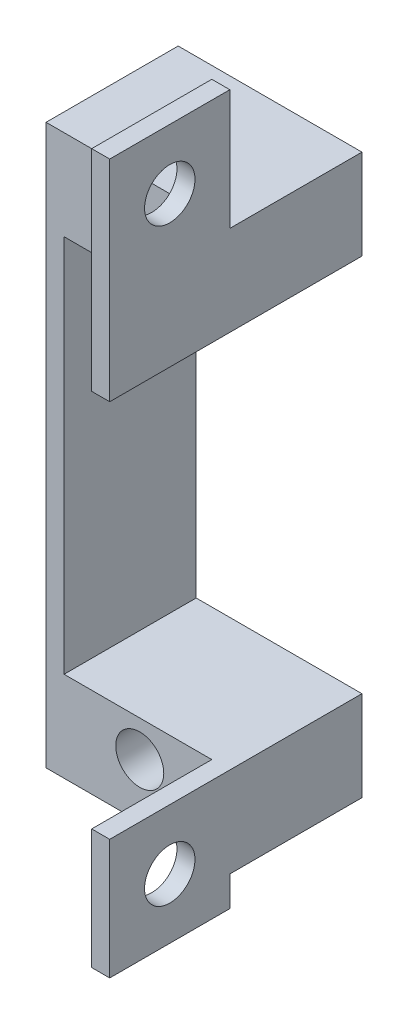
ISO-10303-21;
HEADER;
FILE_DESCRIPTION(('STEP AP214'),'2;1');
FILE_NAME('part.step','',(''),(''),'','','');
FILE_SCHEMA(('AUTOMOTIVE_DESIGN { 1 0 10303 214 1 1 1 1 }'));
ENDSEC;
DATA;
#1=APPLICATION_CONTEXT('core data for automotive mechanical design processes');
#2=APPLICATION_PROTOCOL_DEFINITION('international standard','automotive_design',2000,#1);
#3=PRODUCT_CONTEXT('',#1,'mechanical');
#4=PRODUCT('Part','Part','',(#3));
#5=PRODUCT_RELATED_PRODUCT_CATEGORY('part','',(#4));
#6=PRODUCT_DEFINITION_FORMATION('','',#4);
#7=PRODUCT_DEFINITION_CONTEXT('part definition',#1,'design');
#8=PRODUCT_DEFINITION('design','',#6,#7);
#9=PRODUCT_DEFINITION_SHAPE('','',#8);
#10=(LENGTH_UNIT() NAMED_UNIT(*) SI_UNIT(.MILLI.,.METRE.));
#11=(NAMED_UNIT(*) PLANE_ANGLE_UNIT() SI_UNIT($,.RADIAN.));
#12=(NAMED_UNIT(*) SI_UNIT($,.STERADIAN.) SOLID_ANGLE_UNIT());
#13=UNCERTAINTY_MEASURE_WITH_UNIT(LENGTH_MEASURE(1.E-05),#10,'distance_accuracy_value','');
#14=(GEOMETRIC_REPRESENTATION_CONTEXT(3) GLOBAL_UNCERTAINTY_ASSIGNED_CONTEXT((#13)) GLOBAL_UNIT_ASSIGNED_CONTEXT((#10,
#11,#12)) REPRESENTATION_CONTEXT('',''));
#15=CARTESIAN_POINT('',(0.,0.,0.));
#16=DIRECTION('',(0.,0.,1.));
#17=DIRECTION('',(1.,0.,0.));
#18=AXIS2_PLACEMENT_3D('',#15,#16,#17);
#19=CARTESIAN_POINT('',(0.,0.,11.));
#20=DIRECTION('',(0.,0.,-1.));
#21=DIRECTION('',(-1.,0.,0.));
#22=AXIS2_PLACEMENT_3D('',#19,#20,#21);
#23=PLANE('',#22);
#24=CARTESIAN_POINT('',(-17.0784720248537,38.4232292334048,11.));
#25=DIRECTION('',(0.,0.,1.));
#26=DIRECTION('',(1.,0.,0.));
#27=AXIS2_PLACEMENT_3D('',#24,#25,#26);
#28=CIRCLE('',#27,2.);
#29=CARTESIAN_POINT('',(-15.0784720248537,38.4232292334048,11.));
#30=VERTEX_POINT('',#29);
#31=EDGE_CURVE('E242',#30,#30,#28,.T.);
#32=ORIENTED_EDGE('',*,*,#31,.F.);
#33=EDGE_LOOP('',(#32));
#34=FACE_BOUND('',#33,.T.);
#35=CARTESIAN_POINT('',(-17.0784720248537,0.87322923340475,11.));
#36=DIRECTION('',(0.,0.,-1.));
#37=DIRECTION('',(1.,0.,0.));
#38=AXIS2_PLACEMENT_3D('',#35,#36,#37);
#39=CIRCLE('',#38,2.);
#40=CARTESIAN_POINT('',(-15.0784720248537,0.87322923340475,11.));
#41=VERTEX_POINT('',#40);
#42=EDGE_CURVE('E175',#41,#41,#39,.T.);
#43=ORIENTED_EDGE('',*,*,#42,.T.);
#44=EDGE_LOOP('',(#43));
#45=FACE_BOUND('',#44,.T.);
#46=DIRECTION('',(0.,-1.,0.));
#47=VECTOR('',#46,1.);
#48=CARTESIAN_POINT('',(-11.0784720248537,-3.62677076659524,11.));
#49=LINE('',#48,#47);
#50=CARTESIAN_POINT('',(-11.0784720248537,3.87322923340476,11.));
#51=VERTEX_POINT('',#50);
#52=CARTESIAN_POINT('',(-11.0784720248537,-3.62677076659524,11.));
#53=VERTEX_POINT('',#52);
#54=EDGE_CURVE('E56',#51,#53,#49,.T.);
#55=ORIENTED_EDGE('',*,*,#54,.F.);
#56=DIRECTION('',(-1.,0.,0.));
#57=VECTOR('',#56,1.);
#58=CARTESIAN_POINT('',(3.73505493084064,3.87322923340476,11.));
#59=LINE('',#58,#57);
#60=CARTESIAN_POINT('',(-23.3784720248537,3.87322923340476,11.));
#61=VERTEX_POINT('',#60);
#62=EDGE_CURVE('E193',#51,#61,#59,.T.);
#63=ORIENTED_EDGE('',*,*,#62,.T.);
#64=DIRECTION('',(0.,1.,0.));
#65=VECTOR('',#64,1.);
#66=CARTESIAN_POINT('',(-23.3784720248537,19.6482292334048,11.));
#67=LINE('',#66,#65);
#68=CARTESIAN_POINT('',(-23.3784720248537,35.4232292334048,11.));
#69=VERTEX_POINT('',#68);
#70=EDGE_CURVE('E251',#61,#69,#67,.T.);
#71=ORIENTED_EDGE('',*,*,#70,.T.);
#72=DIRECTION('',(1.,0.,0.));
#73=VECTOR('',#72,1.);
#74=CARTESIAN_POINT('',(-9.57847202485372,35.4232292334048,11.));
#75=LINE('',#74,#73);
#76=CARTESIAN_POINT('',(-11.0784720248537,35.4232292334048,11.));
#77=VERTEX_POINT('',#76);
#78=EDGE_CURVE('E262',#69,#77,#75,.T.);
#79=ORIENTED_EDGE('',*,*,#78,.T.);
#80=DIRECTION('',(0.,1.,0.));
#81=VECTOR('',#80,1.);
#82=CARTESIAN_POINT('',(-11.0784720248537,35.4232292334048,11.));
#83=LINE('',#82,#81);
#84=CARTESIAN_POINT('',(-11.0784720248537,42.9232292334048,11.));
#85=VERTEX_POINT('',#84);
#86=EDGE_CURVE('E230',#77,#85,#83,.T.);
#87=ORIENTED_EDGE('',*,*,#86,.T.);
#88=DIRECTION('',(-1.,0.,0.));
#89=VECTOR('',#88,1.);
#90=CARTESIAN_POINT('',(-9.57847202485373,42.9232292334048,11.));
#91=LINE('',#90,#89);
#92=CARTESIAN_POINT('',(-24.8784720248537,42.9232292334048,11.));
#93=VERTEX_POINT('',#92);
#94=EDGE_CURVE('E256',#85,#93,#91,.T.);
#95=ORIENTED_EDGE('',*,*,#94,.T.);
#96=DIRECTION('',(0.,-1.,0.));
#97=VECTOR('',#96,1.);
#98=CARTESIAN_POINT('',(-24.8784720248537,42.9232292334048,11.));
#99=LINE('',#98,#97);
#100=CARTESIAN_POINT('',(-24.8784720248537,-3.62677076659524,11.));
#101=VERTEX_POINT('',#100);
#102=EDGE_CURVE('E258',#93,#101,#99,.T.);
#103=ORIENTED_EDGE('',*,*,#102,.T.);
#104=DIRECTION('',(-1.,0.,0.));
#105=VECTOR('',#104,1.);
#106=CARTESIAN_POINT('',(-24.8784720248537,-3.62677076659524,11.));
#107=LINE('',#106,#105);
#108=EDGE_CURVE('E203',#53,#101,#107,.T.);
#109=ORIENTED_EDGE('',*,*,#108,.F.);
#110=EDGE_LOOP('',(#55,#63,#71,#79,#87,#95,#103,#109));
#111=FACE_BOUND('',#110,.T.);
#112=ADVANCED_FACE('F34',(#34,#45,#111),#23,.F.);
#113=CARTESIAN_POINT('',(-23.3784720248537,19.6482292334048,11.));
#114=DIRECTION('',(-1.,0.,0.));
#115=DIRECTION('',(0.,0.,1.));
#116=AXIS2_PLACEMENT_3D('',#113,#114,#115);
#117=PLANE('',#116);
#118=DIRECTION('',(0.,0.,1.));
#119=VECTOR('',#118,1.);
#120=CARTESIAN_POINT('',(-23.3784720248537,3.87322923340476,11.));
#121=LINE('',#120,#119);
#122=CARTESIAN_POINT('',(-23.3784720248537,3.87322923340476,0.));
#123=VERTEX_POINT('',#122);
#124=EDGE_CURVE('E181',#123,#61,#121,.T.);
#125=ORIENTED_EDGE('',*,*,#124,.F.);
#126=DIRECTION('',(0.,1.,0.));
#127=VECTOR('',#126,1.);
#128=CARTESIAN_POINT('',(-23.3784720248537,19.6482292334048,0.));
#129=LINE('',#128,#127);
#130=CARTESIAN_POINT('',(-23.3784720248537,35.4232292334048,0.));
#131=VERTEX_POINT('',#130);
#132=EDGE_CURVE('E253',#123,#131,#129,.T.);
#133=ORIENTED_EDGE('',*,*,#132,.T.);
#134=DIRECTION('',(0.,0.,1.));
#135=VECTOR('',#134,1.);
#136=CARTESIAN_POINT('',(-23.3784720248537,35.4232292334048,11.));
#137=LINE('',#136,#135);
#138=EDGE_CURVE('E246',#131,#69,#137,.T.);
#139=ORIENTED_EDGE('',*,*,#138,.T.);
#140=ORIENTED_EDGE('',*,*,#70,.F.);
#141=EDGE_LOOP('',(#125,#133,#139,#140));
#142=FACE_BOUND('',#141,.T.);
#143=ADVANCED_FACE('F317',(#142),#117,.F.);
#144=CARTESIAN_POINT('',(-9.57847202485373,42.9232292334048,11.));
#145=DIRECTION('',(0.,-1.,0.));
#146=DIRECTION('',(0.,0.,-1.));
#147=AXIS2_PLACEMENT_3D('',#144,#145,#146);
#148=PLANE('',#147);
#149=DIRECTION('',(-1.,0.,0.));
#150=VECTOR('',#149,1.);
#151=CARTESIAN_POINT('',(-11.0784720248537,42.9232292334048,11.));
#152=LINE('',#151,#150);
#153=CARTESIAN_POINT('',(-9.57847202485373,42.9232292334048,11.));
#154=VERTEX_POINT('',#153);
#155=EDGE_CURVE('E211',#154,#85,#152,.T.);
#156=ORIENTED_EDGE('',*,*,#155,.F.);
#157=DIRECTION('',(0.,0.,-1.));
#158=VECTOR('',#157,1.);
#159=CARTESIAN_POINT('',(-9.57847202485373,42.9232292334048,11.));
#160=LINE('',#159,#158);
#161=CARTESIAN_POINT('',(-9.57847202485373,42.9232292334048,0.));
#162=VERTEX_POINT('',#161);
#163=EDGE_CURVE('E11',#154,#162,#160,.T.);
#164=ORIENTED_EDGE('',*,*,#163,.T.);
#165=DIRECTION('',(-1.,0.,0.));
#166=VECTOR('',#165,1.);
#167=CARTESIAN_POINT('',(-9.57847202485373,42.9232292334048,0.));
#168=LINE('',#167,#166);
#169=CARTESIAN_POINT('',(-24.8784720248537,42.9232292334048,0.));
#170=VERTEX_POINT('',#169);
#171=EDGE_CURVE('E268',#162,#170,#168,.T.);
#172=ORIENTED_EDGE('',*,*,#171,.T.);
#173=DIRECTION('',(0.,0.,-1.));
#174=VECTOR('',#173,1.);
#175=CARTESIAN_POINT('',(-24.8784720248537,42.9232292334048,11.));
#176=LINE('',#175,#174);
#177=EDGE_CURVE('E42',#93,#170,#176,.T.);
#178=ORIENTED_EDGE('',*,*,#177,.F.);
#179=ORIENTED_EDGE('',*,*,#94,.F.);
#180=EDGE_LOOP('',(#156,#164,#172,#178,#179));
#181=FACE_BOUND('',#180,.T.);
#182=ADVANCED_FACE('F291',(#181),#148,.F.);
#183=CARTESIAN_POINT('',(-9.57847202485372,35.4232292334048,11.));
#184=DIRECTION('',(0.,1.,0.));
#185=DIRECTION('',(0.,0.,1.));
#186=AXIS2_PLACEMENT_3D('',#183,#184,#185);
#187=PLANE('',#186);
#188=ORIENTED_EDGE('',*,*,#138,.F.);
#189=DIRECTION('',(1.,0.,0.));
#190=VECTOR('',#189,1.);
#191=CARTESIAN_POINT('',(-9.57847202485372,35.4232292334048,0.));
#192=LINE('',#191,#190);
#193=CARTESIAN_POINT('',(-9.57847202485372,35.4232292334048,0.));
#194=VERTEX_POINT('',#193);
#195=EDGE_CURVE('E259',#131,#194,#192,.T.);
#196=ORIENTED_EDGE('',*,*,#195,.T.);
#197=DIRECTION('',(0.,0.,-1.));
#198=VECTOR('',#197,1.);
#199=CARTESIAN_POINT('',(-9.57847202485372,35.4232292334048,11.));
#200=LINE('',#199,#198);
#201=CARTESIAN_POINT('',(-9.57847202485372,35.4232292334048,21.));
#202=VERTEX_POINT('',#201);
#203=EDGE_CURVE('E265',#202,#194,#200,.T.);
#204=ORIENTED_EDGE('',*,*,#203,.F.);
#205=DIRECTION('',(-1.,0.,0.));
#206=VECTOR('',#205,1.);
#207=CARTESIAN_POINT('',(-9.57847202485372,35.4232292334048,21.));
#208=LINE('',#207,#206);
#209=CARTESIAN_POINT('',(-11.0784720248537,35.4232292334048,21.));
#210=VERTEX_POINT('',#209);
#211=EDGE_CURVE('E233',#202,#210,#208,.T.);
#212=ORIENTED_EDGE('',*,*,#211,.T.);
#213=DIRECTION('',(0.,0.,-1.));
#214=VECTOR('',#213,1.);
#215=CARTESIAN_POINT('',(-11.0784720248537,35.4232292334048,21.));
#216=LINE('',#215,#214);
#217=EDGE_CURVE('E238',#210,#77,#216,.T.);
#218=ORIENTED_EDGE('',*,*,#217,.T.);
#219=ORIENTED_EDGE('',*,*,#78,.F.);
#220=EDGE_LOOP('',(#188,#196,#204,#212,#218,#219));
#221=FACE_BOUND('',#220,.T.);
#222=ADVANCED_FACE('F311',(#221),#187,.F.);
#223=CARTESIAN_POINT('',(-9.57847202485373,42.9232292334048,11.));
#224=DIRECTION('',(-1.,0.,0.));
#225=DIRECTION('',(0.,-1.,0.));
#226=AXIS2_PLACEMENT_3D('',#223,#224,#225);
#227=PLANE('',#226);
#228=CARTESIAN_POINT('',(-9.57847202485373,47.9232292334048,16.));
#229=DIRECTION('',(-1.,0.,0.));
#230=DIRECTION('',(0.,-1.,0.));
#231=AXIS2_PLACEMENT_3D('',#228,#229,#230);
#232=CIRCLE('',#231,2.1);
#233=CARTESIAN_POINT('',(-9.57847202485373,45.8232292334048,16.));
#234=VERTEX_POINT('',#233);
#235=EDGE_CURVE('E208',#234,#234,#232,.T.);
#236=ORIENTED_EDGE('',*,*,#235,.T.);
#237=EDGE_LOOP('',(#236));
#238=FACE_BOUND('',#237,.T.);
#239=DIRECTION('',(0.,1.,0.));
#240=VECTOR('',#239,1.);
#241=CARTESIAN_POINT('',(-9.57847202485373,42.9232292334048,0.));
#242=LINE('',#241,#240);
#243=EDGE_CURVE('E255',#194,#162,#242,.T.);
#244=ORIENTED_EDGE('',*,*,#243,.T.);
#245=ORIENTED_EDGE('',*,*,#163,.F.);
#246=DIRECTION('',(0.,-1.,0.));
#247=VECTOR('',#246,1.);
#248=CARTESIAN_POINT('',(-9.57847202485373,52.9232292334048,11.));
#249=LINE('',#248,#247);
#250=CARTESIAN_POINT('',(-9.57847202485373,52.9232292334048,11.));
#251=VERTEX_POINT('',#250);
#252=EDGE_CURVE('E227',#251,#154,#249,.T.);
#253=ORIENTED_EDGE('',*,*,#252,.F.);
#254=DIRECTION('',(0.,0.,-1.));
#255=VECTOR('',#254,1.);
#256=CARTESIAN_POINT('',(-9.57847202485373,52.9232292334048,21.));
#257=LINE('',#256,#255);
#258=CARTESIAN_POINT('',(-9.57847202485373,52.9232292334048,21.));
#259=VERTEX_POINT('',#258);
#260=EDGE_CURVE('E218',#259,#251,#257,.T.);
#261=ORIENTED_EDGE('',*,*,#260,.F.);
#262=DIRECTION('',(0.,1.,0.));
#263=VECTOR('',#262,1.);
#264=CARTESIAN_POINT('',(-9.57847202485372,35.4232292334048,21.));
#265=LINE('',#264,#263);
#266=EDGE_CURVE('E236',#202,#259,#265,.T.);
#267=ORIENTED_EDGE('',*,*,#266,.F.);
#268=ORIENTED_EDGE('',*,*,#203,.T.);
#269=EDGE_LOOP('',(#244,#245,#253,#261,#267,#268));
#270=FACE_BOUND('',#269,.T.);
#271=ADVANCED_FACE('F36',(#238,#270),#227,.F.);
#272=CARTESIAN_POINT('',(-24.8784720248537,42.9232292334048,11.));
#273=DIRECTION('',(1.,0.,0.));
#274=DIRECTION('',(0.,0.,-1.));
#275=AXIS2_PLACEMENT_3D('',#272,#273,#274);
#276=PLANE('',#275);
#277=DIRECTION('',(0.,-1.,0.));
#278=VECTOR('',#277,1.);
#279=CARTESIAN_POINT('',(-24.8784720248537,42.9232292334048,0.));
#280=LINE('',#279,#278);
#281=CARTESIAN_POINT('',(-24.8784720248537,-3.62677076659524,0.));
#282=VERTEX_POINT('',#281);
#283=EDGE_CURVE('E270',#170,#282,#280,.T.);
#284=ORIENTED_EDGE('',*,*,#283,.T.);
#285=DIRECTION('',(0.,0.,-1.));
#286=VECTOR('',#285,1.);
#287=CARTESIAN_POINT('',(-24.8784720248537,-3.62677076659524,11.));
#288=LINE('',#287,#286);
#289=EDGE_CURVE('E190',#101,#282,#288,.T.);
#290=ORIENTED_EDGE('',*,*,#289,.F.);
#291=ORIENTED_EDGE('',*,*,#102,.F.);
#292=ORIENTED_EDGE('',*,*,#177,.T.);
#293=EDGE_LOOP('',(#284,#290,#291,#292));
#294=FACE_BOUND('',#293,.T.);
#295=ADVANCED_FACE('F279',(#294),#276,.F.);
#296=CARTESIAN_POINT('',(0.,0.,0.));
#297=DIRECTION('',(0.,0.,-1.));
#298=DIRECTION('',(-1.,0.,0.));
#299=AXIS2_PLACEMENT_3D('',#296,#297,#298);
#300=PLANE('',#299);
#301=CARTESIAN_POINT('',(-17.0784720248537,0.87322923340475,0.));
#302=DIRECTION('',(0.,0.,-1.));
#303=DIRECTION('',(1.,0.,0.));
#304=AXIS2_PLACEMENT_3D('',#301,#302,#303);
#305=CIRCLE('',#304,2.);
#306=CARTESIAN_POINT('',(-15.0784720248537,0.87322923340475,0.));
#307=VERTEX_POINT('',#306);
#308=EDGE_CURVE('E178',#307,#307,#305,.T.);
#309=ORIENTED_EDGE('',*,*,#308,.F.);
#310=EDGE_LOOP('',(#309));
#311=FACE_BOUND('',#310,.T.);
#312=CARTESIAN_POINT('',(-17.0784720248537,38.4232292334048,0.));
#313=DIRECTION('',(0.,0.,1.));
#314=DIRECTION('',(1.,0.,0.));
#315=AXIS2_PLACEMENT_3D('',#312,#313,#314);
#316=CIRCLE('',#315,2.);
#317=CARTESIAN_POINT('',(-15.0784720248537,38.4232292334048,0.));
#318=VERTEX_POINT('',#317);
#319=EDGE_CURVE('E243',#318,#318,#316,.T.);
#320=ORIENTED_EDGE('',*,*,#319,.T.);
#321=EDGE_LOOP('',(#320));
#322=FACE_BOUND('',#321,.T.);
#323=ORIENTED_EDGE('',*,*,#243,.F.);
#324=ORIENTED_EDGE('',*,*,#195,.F.);
#325=ORIENTED_EDGE('',*,*,#132,.F.);
#326=DIRECTION('',(-1.,0.,0.));
#327=VECTOR('',#326,1.);
#328=CARTESIAN_POINT('',(3.73505493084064,3.87322923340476,0.));
#329=LINE('',#328,#327);
#330=CARTESIAN_POINT('',(-9.57847202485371,3.87322923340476,0.));
#331=VERTEX_POINT('',#330);
#332=EDGE_CURVE('E195',#331,#123,#329,.T.);
#333=ORIENTED_EDGE('',*,*,#332,.F.);
#334=DIRECTION('',(0.,-1.,0.));
#335=VECTOR('',#334,1.);
#336=CARTESIAN_POINT('',(-9.57847202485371,-3.62677076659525,0.));
#337=LINE('',#336,#335);
#338=CARTESIAN_POINT('',(-9.57847202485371,-3.62677076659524,0.));
#339=VERTEX_POINT('',#338);
#340=EDGE_CURVE('E184',#331,#339,#337,.T.);
#341=ORIENTED_EDGE('',*,*,#340,.T.);
#342=DIRECTION('',(1.,0.,0.));
#343=VECTOR('',#342,1.);
#344=CARTESIAN_POINT('',(-24.8784720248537,-3.62677076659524,0.));
#345=LINE('',#344,#343);
#346=EDGE_CURVE('E201',#282,#339,#345,.T.);
#347=ORIENTED_EDGE('',*,*,#346,.F.);
#348=ORIENTED_EDGE('',*,*,#283,.F.);
#349=ORIENTED_EDGE('',*,*,#171,.F.);
#350=EDGE_LOOP('',(#323,#324,#325,#333,#341,#347,#348,#349));
#351=FACE_BOUND('',#350,.T.);
#352=ADVANCED_FACE('F286',(#311,#322,#351),#300,.T.);
#353=CARTESIAN_POINT('',(-17.0784720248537,38.4232292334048,0.));
#354=DIRECTION('',(0.,0.,1.));
#355=DIRECTION('',(1.,0.,0.));
#356=AXIS2_PLACEMENT_3D('',#353,#354,#355);
#357=CYLINDRICAL_SURFACE('',#356,2.);
#358=ORIENTED_EDGE('',*,*,#319,.F.);
#359=EDGE_LOOP('',(#358));
#360=FACE_BOUND('',#359,.T.);
#361=ORIENTED_EDGE('',*,*,#31,.T.);
#362=EDGE_LOOP('',(#361));
#363=FACE_BOUND('',#362,.T.);
#364=ADVANCED_FACE('F364',(#360,#363),#357,.F.);
#365=CARTESIAN_POINT('',(-11.0784720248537,35.4232292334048,21.));
#366=DIRECTION('',(-1.,0.,0.));
#367=DIRECTION('',(0.,-1.,0.));
#368=AXIS2_PLACEMENT_3D('',#365,#366,#367);
#369=PLANE('',#368);
#370=CARTESIAN_POINT('',(-11.0784720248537,47.9232292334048,16.));
#371=DIRECTION('',(-1.,0.,0.));
#372=DIRECTION('',(0.,-1.,0.));
#373=AXIS2_PLACEMENT_3D('',#370,#371,#372);
#374=CIRCLE('',#373,2.1);
#375=CARTESIAN_POINT('',(-11.0784720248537,45.8232292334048,16.));
#376=VERTEX_POINT('',#375);
#377=EDGE_CURVE('E205',#376,#376,#374,.T.);
#378=ORIENTED_EDGE('',*,*,#377,.F.);
#379=EDGE_LOOP('',(#378));
#380=FACE_BOUND('',#379,.T.);
#381=ORIENTED_EDGE('',*,*,#86,.F.);
#382=ORIENTED_EDGE('',*,*,#217,.F.);
#383=DIRECTION('',(0.,1.,0.));
#384=VECTOR('',#383,1.);
#385=CARTESIAN_POINT('',(-11.0784720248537,35.4232292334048,21.));
#386=LINE('',#385,#384);
#387=CARTESIAN_POINT('',(-11.0784720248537,52.9232292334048,21.));
#388=VERTEX_POINT('',#387);
#389=EDGE_CURVE('E231',#210,#388,#386,.T.);
#390=ORIENTED_EDGE('',*,*,#389,.T.);
#391=DIRECTION('',(0.,0.,1.));
#392=VECTOR('',#391,1.);
#393=CARTESIAN_POINT('',(-11.0784720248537,52.9232292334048,21.));
#394=LINE('',#393,#392);
#395=CARTESIAN_POINT('',(-11.0784720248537,52.9232292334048,11.));
#396=VERTEX_POINT('',#395);
#397=EDGE_CURVE('E212',#396,#388,#394,.T.);
#398=ORIENTED_EDGE('',*,*,#397,.F.);
#399=DIRECTION('',(0.,-1.,0.));
#400=VECTOR('',#399,1.);
#401=CARTESIAN_POINT('',(-11.0784720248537,52.9232292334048,11.));
#402=LINE('',#401,#400);
#403=EDGE_CURVE('E222',#396,#85,#402,.T.);
#404=ORIENTED_EDGE('',*,*,#403,.T.);
#405=EDGE_LOOP('',(#381,#382,#390,#398,#404));
#406=FACE_BOUND('',#405,.T.);
#407=ADVANCED_FACE('F403',(#380,#406),#369,.T.);
#408=CARTESIAN_POINT('',(0.,0.,21.));
#409=DIRECTION('',(0.,0.,-1.));
#410=DIRECTION('',(-1.,0.,0.));
#411=AXIS2_PLACEMENT_3D('',#408,#409,#410);
#412=PLANE('',#411);
#413=ORIENTED_EDGE('',*,*,#266,.T.);
#414=DIRECTION('',(1.,0.,0.));
#415=VECTOR('',#414,1.);
#416=CARTESIAN_POINT('',(-11.0784720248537,52.9232292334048,21.));
#417=LINE('',#416,#415);
#418=EDGE_CURVE('E215',#388,#259,#417,.T.);
#419=ORIENTED_EDGE('',*,*,#418,.F.);
#420=ORIENTED_EDGE('',*,*,#389,.F.);
#421=ORIENTED_EDGE('',*,*,#211,.F.);
#422=EDGE_LOOP('',(#413,#419,#420,#421));
#423=FACE_BOUND('',#422,.T.);
#424=ADVANCED_FACE('F308',(#423),#412,.F.);
#425=CARTESIAN_POINT('',(-11.0784720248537,52.9232292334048,11.));
#426=DIRECTION('',(0.,0.,1.));
#427=DIRECTION('',(1.,0.,0.));
#428=AXIS2_PLACEMENT_3D('',#425,#426,#427);
#429=PLANE('',#428);
#430=ORIENTED_EDGE('',*,*,#155,.T.);
#431=ORIENTED_EDGE('',*,*,#403,.F.);
#432=DIRECTION('',(-1.,0.,0.));
#433=VECTOR('',#432,1.);
#434=CARTESIAN_POINT('',(-11.0784720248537,52.9232292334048,11.));
#435=LINE('',#434,#433);
#436=EDGE_CURVE('E220',#251,#396,#435,.T.);
#437=ORIENTED_EDGE('',*,*,#436,.F.);
#438=ORIENTED_EDGE('',*,*,#252,.T.);
#439=EDGE_LOOP('',(#430,#431,#437,#438));
#440=FACE_BOUND('',#439,.T.);
#441=ADVANCED_FACE('F299',(#440),#429,.F.);
#442=CARTESIAN_POINT('',(0.,52.9232292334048,0.));
#443=DIRECTION('',(0.,-1.,0.));
#444=DIRECTION('',(0.,0.,-1.));
#445=AXIS2_PLACEMENT_3D('',#442,#443,#444);
#446=PLANE('',#445);
#447=ORIENTED_EDGE('',*,*,#397,.T.);
#448=ORIENTED_EDGE('',*,*,#418,.T.);
#449=ORIENTED_EDGE('',*,*,#260,.T.);
#450=ORIENTED_EDGE('',*,*,#436,.T.);
#451=EDGE_LOOP('',(#447,#448,#449,#450));
#452=FACE_BOUND('',#451,.T.);
#453=ADVANCED_FACE('F302',(#452),#446,.F.);
#454=CARTESIAN_POINT('',(-1.07847202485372,47.9232292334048,16.));
#455=DIRECTION('',(-1.,0.,0.));
#456=DIRECTION('',(0.,-1.,0.));
#457=AXIS2_PLACEMENT_3D('',#454,#455,#456);
#458=CYLINDRICAL_SURFACE('',#457,2.1);
#459=ORIENTED_EDGE('',*,*,#377,.T.);
#460=EDGE_LOOP('',(#459));
#461=FACE_BOUND('',#460,.T.);
#462=ORIENTED_EDGE('',*,*,#235,.F.);
#463=EDGE_LOOP('',(#462));
#464=FACE_BOUND('',#463,.T.);
#465=ADVANCED_FACE('F426',(#461,#464),#458,.F.);
#466=CARTESIAN_POINT('',(0.,-3.62677076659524,0.));
#467=DIRECTION('',(0.,-1.,0.));
#468=DIRECTION('',(0.,0.,-1.));
#469=AXIS2_PLACEMENT_3D('',#466,#467,#468);
#470=PLANE('',#469);
#471=DIRECTION('',(1.,0.,0.));
#472=VECTOR('',#471,1.);
#473=CARTESIAN_POINT('',(-11.0784720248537,-3.62677076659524,11.));
#474=LINE('',#473,#472);
#475=CARTESIAN_POINT('',(-9.57847202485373,-3.62677076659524,11.));
#476=VERTEX_POINT('',#475);
#477=EDGE_CURVE('E49',#53,#476,#474,.T.);
#478=ORIENTED_EDGE('',*,*,#477,.F.);
#479=ORIENTED_EDGE('',*,*,#108,.T.);
#480=ORIENTED_EDGE('',*,*,#289,.T.);
#481=ORIENTED_EDGE('',*,*,#346,.T.);
#482=DIRECTION('',(0.,0.,1.));
#483=VECTOR('',#482,1.);
#484=CARTESIAN_POINT('',(-9.57847202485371,-3.62677076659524,11.));
#485=LINE('',#484,#483);
#486=EDGE_CURVE('E187',#339,#476,#485,.T.);
#487=ORIENTED_EDGE('',*,*,#486,.T.);
#488=EDGE_LOOP('',(#478,#479,#480,#481,#487));
#489=FACE_BOUND('',#488,.T.);
#490=ADVANCED_FACE('F289',(#489),#470,.T.);
#491=CARTESIAN_POINT('',(3.73505493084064,3.87322923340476,11.));
#492=DIRECTION('',(0.,-1.,0.));
#493=DIRECTION('',(0.,0.,-1.));
#494=AXIS2_PLACEMENT_3D('',#491,#492,#493);
#495=PLANE('',#494);
#496=ORIENTED_EDGE('',*,*,#62,.F.);
#497=DIRECTION('',(0.,0.,-1.));
#498=VECTOR('',#497,1.);
#499=CARTESIAN_POINT('',(-11.0784720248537,3.87322923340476,28.6485292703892));
#500=LINE('',#499,#498);
#501=CARTESIAN_POINT('',(-11.0784720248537,3.87322923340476,21.));
#502=VERTEX_POINT('',#501);
#503=EDGE_CURVE('E164',#502,#51,#500,.T.);
#504=ORIENTED_EDGE('',*,*,#503,.F.);
#505=DIRECTION('',(1.,0.,0.));
#506=VECTOR('',#505,1.);
#507=CARTESIAN_POINT('',(-9.57847202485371,3.87322923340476,21.));
#508=LINE('',#507,#506);
#509=CARTESIAN_POINT('',(-9.57847202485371,3.87322923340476,21.));
#510=VERTEX_POINT('',#509);
#511=EDGE_CURVE('E171',#502,#510,#508,.T.);
#512=ORIENTED_EDGE('',*,*,#511,.T.);
#513=DIRECTION('',(0.,0.,-1.));
#514=VECTOR('',#513,1.);
#515=CARTESIAN_POINT('',(-9.57847202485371,3.87322923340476,11.));
#516=LINE('',#515,#514);
#517=EDGE_CURVE('E188',#510,#331,#516,.T.);
#518=ORIENTED_EDGE('',*,*,#517,.T.);
#519=ORIENTED_EDGE('',*,*,#332,.T.);
#520=ORIENTED_EDGE('',*,*,#124,.T.);
#521=EDGE_LOOP('',(#496,#504,#512,#518,#519,#520));
#522=FACE_BOUND('',#521,.T.);
#523=ADVANCED_FACE('F320',(#522),#495,.F.);
#524=CARTESIAN_POINT('',(-9.57847202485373,42.9232292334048,11.));
#525=DIRECTION('',(-1.,0.,0.));
#526=DIRECTION('',(0.,-1.,0.));
#527=AXIS2_PLACEMENT_3D('',#524,#525,#526);
#528=PLANE('',#527);
#529=CARTESIAN_POINT('',(-9.57847202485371,-1.12677076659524,16.));
#530=DIRECTION('',(-1.,0.,0.));
#531=DIRECTION('',(0.,0.,1.));
#532=AXIS2_PLACEMENT_3D('',#529,#530,#531);
#533=CIRCLE('',#532,2.1);
#534=CARTESIAN_POINT('',(-9.57847202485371,-1.12677076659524,18.1));
#535=VERTEX_POINT('',#534);
#536=EDGE_CURVE('E329',#535,#535,#533,.T.);
#537=ORIENTED_EDGE('',*,*,#536,.T.);
#538=EDGE_LOOP('',(#537));
#539=FACE_BOUND('',#538,.T.);
#540=ORIENTED_EDGE('',*,*,#486,.F.);
#541=ORIENTED_EDGE('',*,*,#340,.F.);
#542=ORIENTED_EDGE('',*,*,#517,.F.);
#543=DIRECTION('',(0.,-1.,0.));
#544=VECTOR('',#543,1.);
#545=CARTESIAN_POINT('',(-9.57847202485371,-3.62677076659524,21.));
#546=LINE('',#545,#544);
#547=CARTESIAN_POINT('',(-9.57847202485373,-6.12677076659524,21.));
#548=VERTEX_POINT('',#547);
#549=EDGE_CURVE('E174',#510,#548,#546,.T.);
#550=ORIENTED_EDGE('',*,*,#549,.T.);
#551=DIRECTION('',(0.,0.,1.));
#552=VECTOR('',#551,1.);
#553=CARTESIAN_POINT('',(-9.57847202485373,-6.12677076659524,21.));
#554=LINE('',#553,#552);
#555=CARTESIAN_POINT('',(-9.57847202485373,-6.12677076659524,11.));
#556=VERTEX_POINT('',#555);
#557=EDGE_CURVE('E150',#556,#548,#554,.T.);
#558=ORIENTED_EDGE('',*,*,#557,.F.);
#559=DIRECTION('',(0.,1.,0.));
#560=VECTOR('',#559,1.);
#561=CARTESIAN_POINT('',(-9.57847202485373,-6.12677076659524,11.));
#562=LINE('',#561,#560);
#563=EDGE_CURVE('E146',#556,#476,#562,.T.);
#564=ORIENTED_EDGE('',*,*,#563,.T.);
#565=EDGE_LOOP('',(#540,#541,#542,#550,#558,#564));
#566=FACE_BOUND('',#565,.T.);
#567=ADVANCED_FACE('F324',(#539,#566),#528,.F.);
#568=CARTESIAN_POINT('',(-17.0784720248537,0.87322923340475,0.));
#569=DIRECTION('',(0.,0.,1.));
#570=DIRECTION('',(1.,0.,0.));
#571=AXIS2_PLACEMENT_3D('',#568,#569,#570);
#572=CYLINDRICAL_SURFACE('',#571,2.);
#573=ORIENTED_EDGE('',*,*,#308,.T.);
#574=EDGE_LOOP('',(#573));
#575=FACE_BOUND('',#574,.T.);
#576=ORIENTED_EDGE('',*,*,#42,.F.);
#577=EDGE_LOOP('',(#576));
#578=FACE_BOUND('',#577,.T.);
#579=ADVANCED_FACE('F342',(#575,#578),#572,.F.);
#580=CARTESIAN_POINT('',(-11.0784720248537,-3.62677076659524,28.6485292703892));
#581=DIRECTION('',(1.,0.,0.));
#582=DIRECTION('',(0.,0.,-1.));
#583=AXIS2_PLACEMENT_3D('',#580,#581,#582);
#584=PLANE('',#583);
#585=CARTESIAN_POINT('',(-11.0784720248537,-1.12677076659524,16.));
#586=DIRECTION('',(-1.,0.,0.));
#587=DIRECTION('',(0.,0.,1.));
#588=AXIS2_PLACEMENT_3D('',#585,#586,#587);
#589=CIRCLE('',#588,2.1);
#590=CARTESIAN_POINT('',(-11.0784720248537,-1.12677076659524,18.1));
#591=VERTEX_POINT('',#590);
#592=EDGE_CURVE('E331',#591,#591,#589,.T.);
#593=ORIENTED_EDGE('',*,*,#592,.F.);
#594=EDGE_LOOP('',(#593));
#595=FACE_BOUND('',#594,.T.);
#596=ORIENTED_EDGE('',*,*,#54,.T.);
#597=DIRECTION('',(0.,1.,0.));
#598=VECTOR('',#597,1.);
#599=CARTESIAN_POINT('',(-11.0784720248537,-6.12677076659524,11.));
#600=LINE('',#599,#598);
#601=CARTESIAN_POINT('',(-11.0784720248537,-6.12677076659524,11.));
#602=VERTEX_POINT('',#601);
#603=EDGE_CURVE('E144',#602,#53,#600,.T.);
#604=ORIENTED_EDGE('',*,*,#603,.F.);
#605=DIRECTION('',(0.,0.,-1.));
#606=VECTOR('',#605,1.);
#607=CARTESIAN_POINT('',(-11.0784720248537,-6.12677076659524,21.));
#608=LINE('',#607,#606);
#609=CARTESIAN_POINT('',(-11.0784720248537,-6.12677076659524,21.));
#610=VERTEX_POINT('',#609);
#611=EDGE_CURVE('E151',#610,#602,#608,.T.);
#612=ORIENTED_EDGE('',*,*,#611,.F.);
#613=DIRECTION('',(0.,1.,0.));
#614=VECTOR('',#613,1.);
#615=CARTESIAN_POINT('',(-11.0784720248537,-3.62677076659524,21.));
#616=LINE('',#615,#614);
#617=EDGE_CURVE('E169',#610,#502,#616,.T.);
#618=ORIENTED_EDGE('',*,*,#617,.T.);
#619=ORIENTED_EDGE('',*,*,#503,.T.);
#620=EDGE_LOOP('',(#596,#604,#612,#618,#619));
#621=FACE_BOUND('',#620,.T.);
#622=ADVANCED_FACE('F161',(#595,#621),#584,.F.);
#623=CARTESIAN_POINT('',(0.,0.,21.));
#624=DIRECTION('',(0.,0.,-1.));
#625=DIRECTION('',(-1.,0.,0.));
#626=AXIS2_PLACEMENT_3D('',#623,#624,#625);
#627=PLANE('',#626);
#628=ORIENTED_EDGE('',*,*,#511,.F.);
#629=ORIENTED_EDGE('',*,*,#617,.F.);
#630=DIRECTION('',(-1.,0.,0.));
#631=VECTOR('',#630,1.);
#632=CARTESIAN_POINT('',(-11.0784720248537,-6.12677076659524,21.));
#633=LINE('',#632,#631);
#634=EDGE_CURVE('E157',#548,#610,#633,.T.);
#635=ORIENTED_EDGE('',*,*,#634,.F.);
#636=ORIENTED_EDGE('',*,*,#549,.F.);
#637=EDGE_LOOP('',(#628,#629,#635,#636));
#638=FACE_BOUND('',#637,.T.);
#639=ADVANCED_FACE('F326',(#638),#627,.F.);
#640=CARTESIAN_POINT('',(-11.0784720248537,-6.12677076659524,11.));
#641=DIRECTION('',(0.,0.,1.));
#642=DIRECTION('',(1.,0.,0.));
#643=AXIS2_PLACEMENT_3D('',#640,#641,#642);
#644=PLANE('',#643);
#645=ORIENTED_EDGE('',*,*,#477,.T.);
#646=ORIENTED_EDGE('',*,*,#563,.F.);
#647=DIRECTION('',(1.,0.,0.));
#648=VECTOR('',#647,1.);
#649=CARTESIAN_POINT('',(-11.0784720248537,-6.12677076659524,11.));
#650=LINE('',#649,#648);
#651=EDGE_CURVE('E140',#602,#556,#650,.T.);
#652=ORIENTED_EDGE('',*,*,#651,.F.);
#653=ORIENTED_EDGE('',*,*,#603,.T.);
#654=EDGE_LOOP('',(#645,#646,#652,#653));
#655=FACE_BOUND('',#654,.T.);
#656=ADVANCED_FACE('F142',(#655),#644,.F.);
#657=CARTESIAN_POINT('',(0.,-6.12677076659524,0.));
#658=DIRECTION('',(0.,-1.,0.));
#659=DIRECTION('',(0.,0.,-1.));
#660=AXIS2_PLACEMENT_3D('',#657,#658,#659);
#661=PLANE('',#660);
#662=ORIENTED_EDGE('',*,*,#611,.T.);
#663=ORIENTED_EDGE('',*,*,#651,.T.);
#664=ORIENTED_EDGE('',*,*,#557,.T.);
#665=ORIENTED_EDGE('',*,*,#634,.T.);
#666=EDGE_LOOP('',(#662,#663,#664,#665));
#667=FACE_BOUND('',#666,.T.);
#668=ADVANCED_FACE('F155',(#667),#661,.T.);
#669=CARTESIAN_POINT('',(-9.57847202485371,-1.12677076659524,16.));
#670=DIRECTION('',(-1.,0.,0.));
#671=DIRECTION('',(0.,0.,1.));
#672=AXIS2_PLACEMENT_3D('',#669,#670,#671);
#673=CYLINDRICAL_SURFACE('',#672,2.1);
#674=ORIENTED_EDGE('',*,*,#536,.F.);
#675=EDGE_LOOP('',(#674));
#676=FACE_BOUND('',#675,.T.);
#677=ORIENTED_EDGE('',*,*,#592,.T.);
#678=EDGE_LOOP('',(#677));
#679=FACE_BOUND('',#678,.T.);
#680=ADVANCED_FACE('F339',(#676,#679),#673,.F.);
#681=CLOSED_SHELL('',(#112,#143,#182,#222,#271,#295,#352,#364,#407,#424,#441,#453,#465,#490,
#523,#567,#579,#622,#639,#656,#668,#680));
#682=MANIFOLD_SOLID_BREP('B2',#681);
#683=ADVANCED_BREP_SHAPE_REPRESENTATION('',(#18,#682),#14);
#684=SHAPE_DEFINITION_REPRESENTATION(#9,#683);
ENDSEC;
END-ISO-10303-21;
